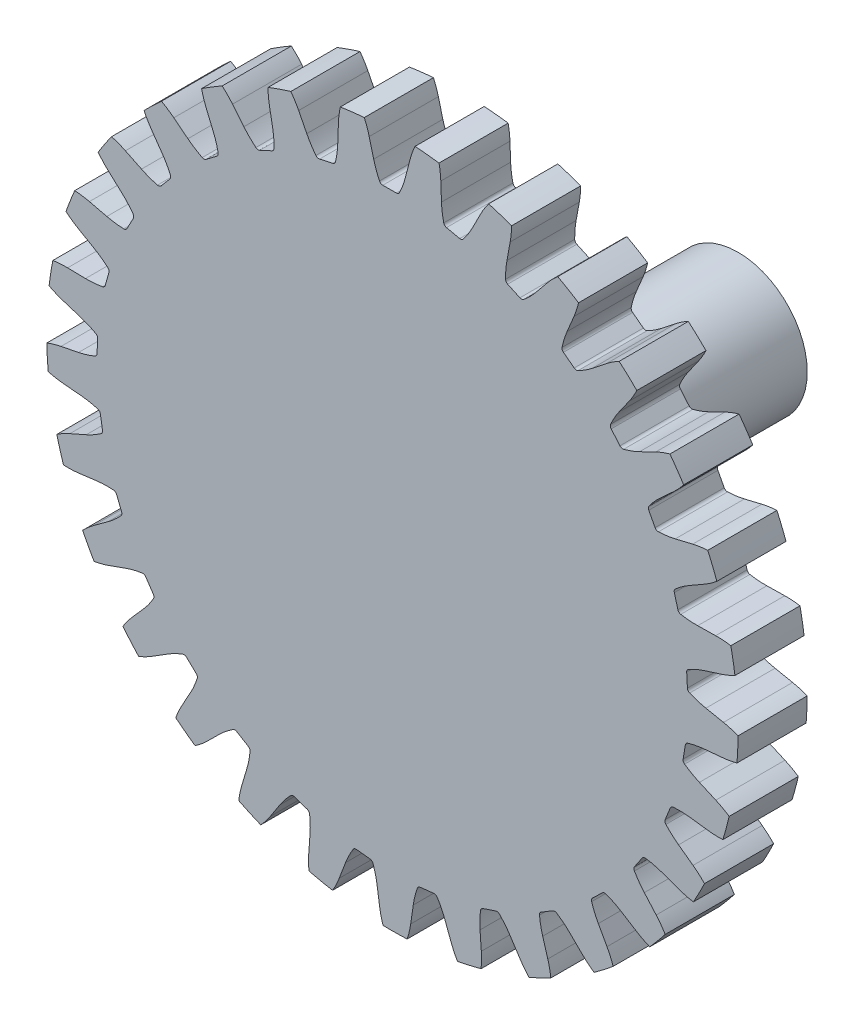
from build123d import *

# Parameters (mm, degrees)
SKETCH1_R          = 63.5
EXTRUDE1_DEPTH     = 12.7
SKETCH3_R          = 12.7
EXTRUDE2_DEPTH     = 50.8
CUT_EXTRUDE2_DEPTH = 122.121019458
CIRPATTERN3_COUNT  = 29


with BuildPart() as part:
    # Sketch1 → Extrude1 (new body)
    with BuildSketch(Plane.XY):
        Circle(SKETCH1_R)
    extrude(amount=EXTRUDE1_DEPTH)

    # Sketch3 → Extrude2 (add)
    with BuildSketch(Plane(origin=(0, 0, 0), x_dir=(-1, 0, 0), z_dir=(0, 0, -1))):
        with Locations(Location((0, 0, 0), (0, 0, 180))):
            Circle(SKETCH3_R)
    extrude(amount=EXTRUDE2_DEPTH)

    # Sketch4 → Cut-Extrude2 (cut, through all)
    with BuildSketch(Plane(origin=(-0.53626367, -17.354241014, 12.7), x_dir=(1, 0, 0), z_dir=(0, 0, 1))):
        with BuildLine():
            Line((-129.068430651, 352.093803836), (-4.656553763, 80.717984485))
            ThreePointArc((-4.656553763, 80.717984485), (-4.128869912, 79.418245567), (-3.717983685, 78.076998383))
            Line((-3.717983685, 78.076998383), (-2.894365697, 74.892303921))
            ThreePointArc((-2.894365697, 74.892303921), (-2.42922611, 73.400796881), (-1.819728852, 71.96223469))
            ThreePointArc((-1.819728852, 71.96223469), (-1.574529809, 71.688347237), (-1.221257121, 71.586684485))
            Line((-1.221257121, 71.586684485), (1.25861219, 71.586684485))
            ThreePointArc((1.25861219, 71.586684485), (1.611884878, 71.688347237), (1.85708392, 71.96223469))
            ThreePointArc((1.85708392, 71.96223469), (2.466581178, 73.400796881), (2.931720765, 74.892303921))
            Line((2.931720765, 74.892303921), (3.755338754, 78.076998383))
            ThreePointArc((3.755338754, 78.076998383), (4.16622498, 79.418245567), (4.693908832, 80.717984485))
            Line((4.693908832, 80.717984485), (129.10578572, 352.093803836))
            Line((129.10578572, 352.093803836), (129.10578572, 949.163817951))
            Line((129.10578572, 949.163817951), (-129.068430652, 949.163817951))
            Line((-129.068430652, 949.163817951), (-129.068430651, 352.093803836))
        make_face()
    cut_extrude2 = extrude(amount=-CUT_EXTRUDE2_DEPTH, mode=Mode.SUBTRACT)

    # CirPattern3: Cut-Extrude2 ×29 about axis
    cirpattern3_axis = Axis((0, 0, 0), (0, 0, 1))
    for i in range(1, CIRPATTERN3_COUNT):
        add(cut_extrude2.rotate(cirpattern3_axis, i * 360 / CIRPATTERN3_COUNT), mode=Mode.SUBTRACT)


solid = part.part
